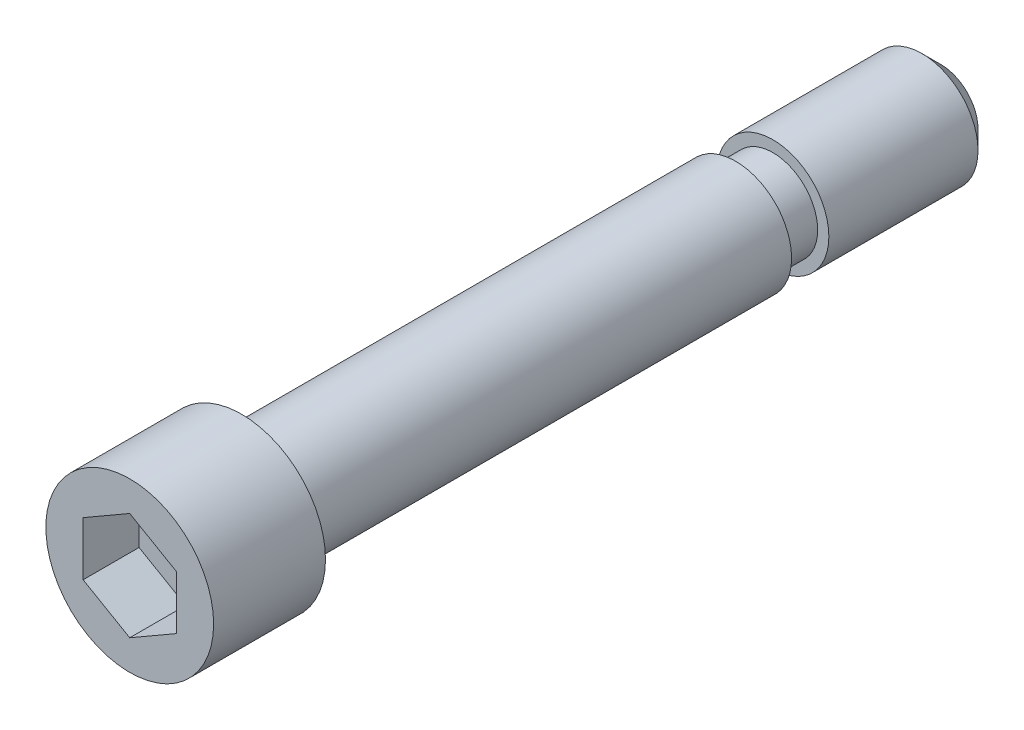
ISO-10303-21;
HEADER;
FILE_DESCRIPTION(('STEP AP214'),'2;1');
FILE_NAME('part.step','',(''),(''),'','','');
FILE_SCHEMA(('AUTOMOTIVE_DESIGN { 1 0 10303 214 1 1 1 1 }'));
ENDSEC;
DATA;
#1=APPLICATION_CONTEXT('core data for automotive mechanical design processes');
#2=APPLICATION_PROTOCOL_DEFINITION('international standard','automotive_design',2000,#1);
#3=PRODUCT_CONTEXT('',#1,'mechanical');
#4=PRODUCT('Part','Part','',(#3));
#5=PRODUCT_RELATED_PRODUCT_CATEGORY('part','',(#4));
#6=PRODUCT_DEFINITION_FORMATION('','',#4);
#7=PRODUCT_DEFINITION_CONTEXT('part definition',#1,'design');
#8=PRODUCT_DEFINITION('design','',#6,#7);
#9=PRODUCT_DEFINITION_SHAPE('','',#8);
#10=(LENGTH_UNIT() NAMED_UNIT(*) SI_UNIT(.MILLI.,.METRE.));
#11=(NAMED_UNIT(*) PLANE_ANGLE_UNIT() SI_UNIT($,.RADIAN.));
#12=(NAMED_UNIT(*) SI_UNIT($,.STERADIAN.) SOLID_ANGLE_UNIT());
#13=UNCERTAINTY_MEASURE_WITH_UNIT(LENGTH_MEASURE(1.E-05),#10,'distance_accuracy_value','');
#14=(GEOMETRIC_REPRESENTATION_CONTEXT(3) GLOBAL_UNCERTAINTY_ASSIGNED_CONTEXT((#13)) GLOBAL_UNIT_ASSIGNED_CONTEXT((#10,
#11,#12)) REPRESENTATION_CONTEXT('',''));
#15=CARTESIAN_POINT('',(0.,0.,0.));
#16=DIRECTION('',(0.,0.,1.));
#17=DIRECTION('',(1.,0.,0.));
#18=AXIS2_PLACEMENT_3D('',#15,#16,#17);
#19=CARTESIAN_POINT('',(0.,0.,-75.));
#20=DIRECTION('',(0.,0.,1.));
#21=DIRECTION('',(1.,0.,0.));
#22=AXIS2_PLACEMENT_3D('',#19,#20,#21);
#23=PLANE('',#22);
#24=CARTESIAN_POINT('',(0.,0.,-75.));
#25=DIRECTION('',(0.,0.,1.));
#26=DIRECTION('',(1.,0.,0.));
#27=AXIS2_PLACEMENT_3D('',#24,#25,#26);
#28=CIRCLE('',#27,4.);
#29=CARTESIAN_POINT('',(4.,0.,-75.));
#30=VERTEX_POINT('',#29);
#31=EDGE_CURVE('E9',#30,#30,#28,.T.);
#32=ORIENTED_EDGE('',*,*,#31,.F.);
#33=EDGE_LOOP('',(#32));
#34=FACE_BOUND('',#33,.T.);
#35=ADVANCED_FACE('F14',(#34),#23,.F.);
#36=CARTESIAN_POINT('',(0.,0.,-75.));
#37=DIRECTION('',(0.,0.,1.));
#38=DIRECTION('',(1.,0.,0.));
#39=AXIS2_PLACEMENT_3D('',#36,#37,#38);
#40=CONICAL_SURFACE('',#39,4.,0.785398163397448);
#41=CARTESIAN_POINT('',(0.,0.,-73.));
#42=DIRECTION('',(0.,0.,1.));
#43=DIRECTION('',(1.,0.,0.));
#44=AXIS2_PLACEMENT_3D('',#41,#42,#43);
#45=CIRCLE('',#44,6.);
#46=CARTESIAN_POINT('',(6.,0.,-73.));
#47=VERTEX_POINT('',#46);
#48=EDGE_CURVE('E21',#47,#47,#45,.T.);
#49=ORIENTED_EDGE('',*,*,#48,.F.);
#50=EDGE_LOOP('',(#49));
#51=FACE_BOUND('',#50,.T.);
#52=ORIENTED_EDGE('',*,*,#31,.T.);
#53=EDGE_LOOP('',(#52));
#54=FACE_BOUND('',#53,.T.);
#55=ADVANCED_FACE('F147',(#51,#54),#40,.T.);
#56=CARTESIAN_POINT('',(0.,0.,5.));
#57=DIRECTION('',(0.,0.,1.));
#58=DIRECTION('',(1.,0.,0.));
#59=AXIS2_PLACEMENT_3D('',#56,#57,#58);
#60=CYLINDRICAL_SURFACE('',#59,6.);
#61=CARTESIAN_POINT('',(0.,0.,-57.));
#62=DIRECTION('',(0.,0.,1.));
#63=DIRECTION('',(1.,0.,0.));
#64=AXIS2_PLACEMENT_3D('',#61,#62,#63);
#65=CIRCLE('',#64,6.);
#66=CARTESIAN_POINT('',(6.,0.,-57.));
#67=VERTEX_POINT('',#66);
#68=EDGE_CURVE('E140',#67,#67,#65,.T.);
#69=ORIENTED_EDGE('',*,*,#68,.F.);
#70=EDGE_LOOP('',(#69));
#71=FACE_BOUND('',#70,.T.);
#72=ORIENTED_EDGE('',*,*,#48,.T.);
#73=EDGE_LOOP('',(#72));
#74=FACE_BOUND('',#73,.T.);
#75=ADVANCED_FACE('F145',(#71,#74),#60,.T.);
#76=CARTESIAN_POINT('',(-6.,0.,-57.));
#77=DIRECTION('',(0.,0.,-1.));
#78=DIRECTION('',(-1.,0.,0.));
#79=AXIS2_PLACEMENT_3D('',#76,#77,#78);
#80=PLANE('',#79);
#81=CARTESIAN_POINT('',(0.,0.,-57.));
#82=DIRECTION('',(0.,0.,1.));
#83=DIRECTION('',(1.,0.,0.));
#84=AXIS2_PLACEMENT_3D('',#81,#82,#83);
#85=CIRCLE('',#84,4.8);
#86=CARTESIAN_POINT('',(4.8,0.,-57.));
#87=VERTEX_POINT('',#86);
#88=EDGE_CURVE('E137',#87,#87,#85,.T.);
#89=ORIENTED_EDGE('',*,*,#88,.F.);
#90=EDGE_LOOP('',(#89));
#91=FACE_BOUND('',#90,.T.);
#92=ORIENTED_EDGE('',*,*,#68,.T.);
#93=EDGE_LOOP('',(#92));
#94=FACE_BOUND('',#93,.T.);
#95=ADVANCED_FACE('F170',(#91,#94),#80,.F.);
#96=CARTESIAN_POINT('',(0.,0.,5.));
#97=DIRECTION('',(0.,0.,1.));
#98=DIRECTION('',(1.,0.,0.));
#99=AXIS2_PLACEMENT_3D('',#96,#97,#98);
#100=CYLINDRICAL_SURFACE('',#99,4.8);
#101=CARTESIAN_POINT('',(0.,0.,-53.));
#102=DIRECTION('',(0.,0.,1.));
#103=DIRECTION('',(1.,0.,0.));
#104=AXIS2_PLACEMENT_3D('',#101,#102,#103);
#105=CIRCLE('',#104,4.8);
#106=CARTESIAN_POINT('',(4.8,0.,-53.));
#107=VERTEX_POINT('',#106);
#108=EDGE_CURVE('E134',#107,#107,#105,.T.);
#109=ORIENTED_EDGE('',*,*,#108,.F.);
#110=EDGE_LOOP('',(#109));
#111=FACE_BOUND('',#110,.T.);
#112=ORIENTED_EDGE('',*,*,#88,.T.);
#113=EDGE_LOOP('',(#112));
#114=FACE_BOUND('',#113,.T.);
#115=ADVANCED_FACE('F179',(#111,#114),#100,.T.);
#116=CARTESIAN_POINT('',(-4.8,0.,-53.));
#117=DIRECTION('',(0.,0.,1.));
#118=DIRECTION('',(1.,0.,0.));
#119=AXIS2_PLACEMENT_3D('',#116,#117,#118);
#120=PLANE('',#119);
#121=CARTESIAN_POINT('',(0.,0.,-53.));
#122=DIRECTION('',(0.,0.,1.));
#123=DIRECTION('',(1.,0.,0.));
#124=AXIS2_PLACEMENT_3D('',#121,#122,#123);
#125=CIRCLE('',#124,6.);
#126=CARTESIAN_POINT('',(6.,0.,-53.));
#127=VERTEX_POINT('',#126);
#128=EDGE_CURVE('E131',#127,#127,#125,.T.);
#129=ORIENTED_EDGE('',*,*,#128,.F.);
#130=EDGE_LOOP('',(#129));
#131=FACE_BOUND('',#130,.T.);
#132=ORIENTED_EDGE('',*,*,#108,.T.);
#133=EDGE_LOOP('',(#132));
#134=FACE_BOUND('',#133,.T.);
#135=ADVANCED_FACE('F188',(#131,#134),#120,.F.);
#136=CARTESIAN_POINT('',(0.,0.,5.));
#137=DIRECTION('',(0.,0.,1.));
#138=DIRECTION('',(1.,0.,0.));
#139=AXIS2_PLACEMENT_3D('',#136,#137,#138);
#140=CYLINDRICAL_SURFACE('',#139,6.);
#141=CARTESIAN_POINT('',(0.,0.,0.));
#142=DIRECTION('',(0.,0.,1.));
#143=DIRECTION('',(1.,0.,0.));
#144=AXIS2_PLACEMENT_3D('',#141,#142,#143);
#145=CIRCLE('',#144,6.);
#146=CARTESIAN_POINT('',(6.,0.,0.));
#147=VERTEX_POINT('',#146);
#148=EDGE_CURVE('E128',#147,#147,#145,.T.);
#149=ORIENTED_EDGE('',*,*,#148,.F.);
#150=EDGE_LOOP('',(#149));
#151=FACE_BOUND('',#150,.T.);
#152=ORIENTED_EDGE('',*,*,#128,.T.);
#153=EDGE_LOOP('',(#152));
#154=FACE_BOUND('',#153,.T.);
#155=ADVANCED_FACE('F197',(#151,#154),#140,.T.);
#156=CARTESIAN_POINT('',(-6.,0.,0.));
#157=DIRECTION('',(0.,0.,1.));
#158=DIRECTION('',(1.,0.,0.));
#159=AXIS2_PLACEMENT_3D('',#156,#157,#158);
#160=PLANE('',#159);
#161=CARTESIAN_POINT('',(0.,0.,0.));
#162=DIRECTION('',(0.,0.,1.));
#163=DIRECTION('',(1.,0.,0.));
#164=AXIS2_PLACEMENT_3D('',#161,#162,#163);
#165=CIRCLE('',#164,9.);
#166=CARTESIAN_POINT('',(9.,0.,0.));
#167=VERTEX_POINT('',#166);
#168=EDGE_CURVE('E125',#167,#167,#165,.T.);
#169=ORIENTED_EDGE('',*,*,#168,.F.);
#170=EDGE_LOOP('',(#169));
#171=FACE_BOUND('',#170,.T.);
#172=ORIENTED_EDGE('',*,*,#148,.T.);
#173=EDGE_LOOP('',(#172));
#174=FACE_BOUND('',#173,.T.);
#175=ADVANCED_FACE('F206',(#171,#174),#160,.F.);
#176=CARTESIAN_POINT('',(0.,0.,5.));
#177=DIRECTION('',(0.,0.,1.));
#178=DIRECTION('',(1.,0.,0.));
#179=AXIS2_PLACEMENT_3D('',#176,#177,#178);
#180=CYLINDRICAL_SURFACE('',#179,9.);
#181=CARTESIAN_POINT('',(0.,0.,12.));
#182=DIRECTION('',(0.,0.,1.));
#183=DIRECTION('',(1.,0.,0.));
#184=AXIS2_PLACEMENT_3D('',#181,#182,#183);
#185=CIRCLE('',#184,9.);
#186=CARTESIAN_POINT('',(9.,0.,12.));
#187=VERTEX_POINT('',#186);
#188=EDGE_CURVE('E116',#187,#187,#185,.T.);
#189=ORIENTED_EDGE('',*,*,#188,.F.);
#190=EDGE_LOOP('',(#189));
#191=FACE_BOUND('',#190,.T.);
#192=ORIENTED_EDGE('',*,*,#168,.T.);
#193=EDGE_LOOP('',(#192));
#194=FACE_BOUND('',#193,.T.);
#195=ADVANCED_FACE('F215',(#191,#194),#180,.T.);
#196=CARTESIAN_POINT('',(-9.,0.,12.));
#197=DIRECTION('',(0.,0.,-1.));
#198=DIRECTION('',(-1.,0.,0.));
#199=AXIS2_PLACEMENT_3D('',#196,#197,#198);
#200=PLANE('',#199);
#201=DIRECTION('',(-0.866025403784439,-0.5,0.));
#202=VECTOR('',#201,1.);
#203=CARTESIAN_POINT('',(0.,5.77350269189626,12.));
#204=LINE('',#203,#202);
#205=CARTESIAN_POINT('',(0.,5.77350269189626,12.));
#206=VERTEX_POINT('',#205);
#207=CARTESIAN_POINT('',(-5.,2.88675134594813,12.));
#208=VERTEX_POINT('',#207);
#209=EDGE_CURVE('E82',#206,#208,#204,.T.);
#210=ORIENTED_EDGE('',*,*,#209,.F.);
#211=DIRECTION('',(-0.866025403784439,0.5,0.));
#212=VECTOR('',#211,1.);
#213=CARTESIAN_POINT('',(5.,2.88675134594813,12.));
#214=LINE('',#213,#212);
#215=CARTESIAN_POINT('',(5.,2.88675134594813,12.));
#216=VERTEX_POINT('',#215);
#217=EDGE_CURVE('E28',#216,#206,#214,.T.);
#218=ORIENTED_EDGE('',*,*,#217,.F.);
#219=DIRECTION('',(0.,1.,0.));
#220=VECTOR('',#219,1.);
#221=CARTESIAN_POINT('',(5.,-2.88675134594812,12.));
#222=LINE('',#221,#220);
#223=CARTESIAN_POINT('',(5.,-2.88675134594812,12.));
#224=VERTEX_POINT('',#223);
#225=EDGE_CURVE('E98',#224,#216,#222,.T.);
#226=ORIENTED_EDGE('',*,*,#225,.F.);
#227=DIRECTION('',(0.866025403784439,0.5,0.));
#228=VECTOR('',#227,1.);
#229=CARTESIAN_POINT('',(0.,-5.77350269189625,12.));
#230=LINE('',#229,#228);
#231=CARTESIAN_POINT('',(0.,-5.77350269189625,12.));
#232=VERTEX_POINT('',#231);
#233=EDGE_CURVE('E92',#232,#224,#230,.T.);
#234=ORIENTED_EDGE('',*,*,#233,.F.);
#235=DIRECTION('',(0.866025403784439,-0.5,0.));
#236=VECTOR('',#235,1.);
#237=CARTESIAN_POINT('',(-5.,-2.88675134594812,12.));
#238=LINE('',#237,#236);
#239=CARTESIAN_POINT('',(-5.,-2.88675134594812,12.));
#240=VERTEX_POINT('',#239);
#241=EDGE_CURVE('E90',#240,#232,#238,.T.);
#242=ORIENTED_EDGE('',*,*,#241,.F.);
#243=DIRECTION('',(0.,-1.,0.));
#244=VECTOR('',#243,1.);
#245=CARTESIAN_POINT('',(-5.,2.88675134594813,12.));
#246=LINE('',#245,#244);
#247=EDGE_CURVE('E71',#208,#240,#246,.T.);
#248=ORIENTED_EDGE('',*,*,#247,.F.);
#249=EDGE_LOOP('',(#210,#218,#226,#234,#242,#248));
#250=FACE_BOUND('',#249,.T.);
#251=ORIENTED_EDGE('',*,*,#188,.T.);
#252=EDGE_LOOP('',(#251));
#253=FACE_BOUND('',#252,.T.);
#254=ADVANCED_FACE('F86',(#250,#253),#200,.F.);
#255=CARTESIAN_POINT('',(5.,2.88675134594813,6.));
#256=DIRECTION('',(0.5,0.866025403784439,0.));
#257=DIRECTION('',(-0.866025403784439,0.5,0.));
#258=AXIS2_PLACEMENT_3D('',#255,#256,#257);
#259=PLANE('',#258);
#260=ORIENTED_EDGE('',*,*,#217,.T.);
#261=DIRECTION('',(0.,0.,1.));
#262=VECTOR('',#261,1.);
#263=CARTESIAN_POINT('',(0.,5.77350269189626,6.));
#264=LINE('',#263,#262);
#265=CARTESIAN_POINT('',(0.,5.77350269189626,6.));
#266=VERTEX_POINT('',#265);
#267=EDGE_CURVE('E79',#266,#206,#264,.T.);
#268=ORIENTED_EDGE('',*,*,#267,.F.);
#269=DIRECTION('',(-0.866025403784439,0.5,0.));
#270=VECTOR('',#269,1.);
#271=CARTESIAN_POINT('',(5.,2.88675134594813,6.));
#272=LINE('',#271,#270);
#273=CARTESIAN_POINT('',(5.,2.88675134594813,6.));
#274=VERTEX_POINT('',#273);
#275=EDGE_CURVE('E100',#274,#266,#272,.T.);
#276=ORIENTED_EDGE('',*,*,#275,.F.);
#277=DIRECTION('',(0.,0.,1.));
#278=VECTOR('',#277,1.);
#279=CARTESIAN_POINT('',(5.,2.88675134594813,6.));
#280=LINE('',#279,#278);
#281=EDGE_CURVE('E35',#274,#216,#280,.T.);
#282=ORIENTED_EDGE('',*,*,#281,.T.);
#283=EDGE_LOOP('',(#260,#268,#276,#282));
#284=FACE_BOUND('',#283,.T.);
#285=ADVANCED_FACE('F232',(#284),#259,.F.);
#286=CARTESIAN_POINT('',(5.,-2.88675134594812,6.));
#287=DIRECTION('',(1.,0.,0.));
#288=DIRECTION('',(0.,0.,-1.));
#289=AXIS2_PLACEMENT_3D('',#286,#287,#288);
#290=PLANE('',#289);
#291=ORIENTED_EDGE('',*,*,#225,.T.);
#292=ORIENTED_EDGE('',*,*,#281,.F.);
#293=DIRECTION('',(0.,1.,0.));
#294=VECTOR('',#293,1.);
#295=CARTESIAN_POINT('',(5.,-2.88675134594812,6.));
#296=LINE('',#295,#294);
#297=CARTESIAN_POINT('',(5.,-2.88675134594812,6.));
#298=VERTEX_POINT('',#297);
#299=EDGE_CURVE('E112',#298,#274,#296,.T.);
#300=ORIENTED_EDGE('',*,*,#299,.F.);
#301=DIRECTION('',(0.,0.,1.));
#302=VECTOR('',#301,1.);
#303=CARTESIAN_POINT('',(5.,-2.88675134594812,6.));
#304=LINE('',#303,#302);
#305=EDGE_CURVE('E117',#298,#224,#304,.T.);
#306=ORIENTED_EDGE('',*,*,#305,.T.);
#307=EDGE_LOOP('',(#291,#292,#300,#306));
#308=FACE_BOUND('',#307,.T.);
#309=ADVANCED_FACE('F240',(#308),#290,.F.);
#310=CARTESIAN_POINT('',(0.,-5.77350269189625,6.));
#311=DIRECTION('',(0.5,-0.866025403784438,0.));
#312=DIRECTION('',(0.866025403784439,0.5,0.));
#313=AXIS2_PLACEMENT_3D('',#310,#311,#312);
#314=PLANE('',#313);
#315=ORIENTED_EDGE('',*,*,#233,.T.);
#316=ORIENTED_EDGE('',*,*,#305,.F.);
#317=DIRECTION('',(0.866025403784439,0.5,0.));
#318=VECTOR('',#317,1.);
#319=CARTESIAN_POINT('',(0.,-5.77350269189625,6.));
#320=LINE('',#319,#318);
#321=CARTESIAN_POINT('',(0.,-5.77350269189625,6.));
#322=VERTEX_POINT('',#321);
#323=EDGE_CURVE('E109',#322,#298,#320,.T.);
#324=ORIENTED_EDGE('',*,*,#323,.F.);
#325=DIRECTION('',(0.,0.,1.));
#326=VECTOR('',#325,1.);
#327=CARTESIAN_POINT('',(0.,-5.77350269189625,6.));
#328=LINE('',#327,#326);
#329=EDGE_CURVE('E119',#322,#232,#328,.T.);
#330=ORIENTED_EDGE('',*,*,#329,.T.);
#331=EDGE_LOOP('',(#315,#316,#324,#330));
#332=FACE_BOUND('',#331,.T.);
#333=ADVANCED_FACE('F248',(#332),#314,.F.);
#334=CARTESIAN_POINT('',(-5.,-2.88675134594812,6.));
#335=DIRECTION('',(-0.5,-0.866025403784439,0.));
#336=DIRECTION('',(0.866025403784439,-0.5,0.));
#337=AXIS2_PLACEMENT_3D('',#334,#335,#336);
#338=PLANE('',#337);
#339=ORIENTED_EDGE('',*,*,#241,.T.);
#340=ORIENTED_EDGE('',*,*,#329,.F.);
#341=DIRECTION('',(0.866025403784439,-0.5,0.));
#342=VECTOR('',#341,1.);
#343=CARTESIAN_POINT('',(-5.,-2.88675134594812,6.));
#344=LINE('',#343,#342);
#345=CARTESIAN_POINT('',(-5.,-2.88675134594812,6.));
#346=VERTEX_POINT('',#345);
#347=EDGE_CURVE('E106',#346,#322,#344,.T.);
#348=ORIENTED_EDGE('',*,*,#347,.F.);
#349=DIRECTION('',(0.,0.,1.));
#350=VECTOR('',#349,1.);
#351=CARTESIAN_POINT('',(-5.,-2.88675134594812,6.));
#352=LINE('',#351,#350);
#353=EDGE_CURVE('E78',#346,#240,#352,.T.);
#354=ORIENTED_EDGE('',*,*,#353,.T.);
#355=EDGE_LOOP('',(#339,#340,#348,#354));
#356=FACE_BOUND('',#355,.T.);
#357=ADVANCED_FACE('F256',(#356),#338,.F.);
#358=CARTESIAN_POINT('',(-5.,2.88675134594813,6.));
#359=DIRECTION('',(-1.,0.,0.));
#360=DIRECTION('',(0.,0.,1.));
#361=AXIS2_PLACEMENT_3D('',#358,#359,#360);
#362=PLANE('',#361);
#363=ORIENTED_EDGE('',*,*,#247,.T.);
#364=ORIENTED_EDGE('',*,*,#353,.F.);
#365=DIRECTION('',(0.,-1.,0.));
#366=VECTOR('',#365,1.);
#367=CARTESIAN_POINT('',(-5.,2.88675134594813,6.));
#368=LINE('',#367,#366);
#369=CARTESIAN_POINT('',(-5.,2.88675134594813,6.));
#370=VERTEX_POINT('',#369);
#371=EDGE_CURVE('E74',#370,#346,#368,.T.);
#372=ORIENTED_EDGE('',*,*,#371,.F.);
#373=DIRECTION('',(0.,0.,1.));
#374=VECTOR('',#373,1.);
#375=CARTESIAN_POINT('',(-5.,2.88675134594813,6.));
#376=LINE('',#375,#374);
#377=EDGE_CURVE('E67',#370,#208,#376,.T.);
#378=ORIENTED_EDGE('',*,*,#377,.T.);
#379=EDGE_LOOP('',(#363,#364,#372,#378));
#380=FACE_BOUND('',#379,.T.);
#381=ADVANCED_FACE('F69',(#380),#362,.F.);
#382=CARTESIAN_POINT('',(0.,5.77350269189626,6.));
#383=DIRECTION('',(-0.5,0.866025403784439,0.));
#384=DIRECTION('',(-0.866025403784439,-0.5,0.));
#385=AXIS2_PLACEMENT_3D('',#382,#383,#384);
#386=PLANE('',#385);
#387=ORIENTED_EDGE('',*,*,#209,.T.);
#388=ORIENTED_EDGE('',*,*,#377,.F.);
#389=DIRECTION('',(-0.866025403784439,-0.5,0.));
#390=VECTOR('',#389,1.);
#391=CARTESIAN_POINT('',(0.,5.77350269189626,6.));
#392=LINE('',#391,#390);
#393=EDGE_CURVE('E103',#266,#370,#392,.T.);
#394=ORIENTED_EDGE('',*,*,#393,.F.);
#395=ORIENTED_EDGE('',*,*,#267,.T.);
#396=EDGE_LOOP('',(#387,#388,#394,#395));
#397=FACE_BOUND('',#396,.T.);
#398=ADVANCED_FACE('F83',(#397),#386,.F.);
#399=CARTESIAN_POINT('',(5.,2.88675134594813,6.));
#400=DIRECTION('',(0.,0.,-1.));
#401=DIRECTION('',(-1.,0.,0.));
#402=AXIS2_PLACEMENT_3D('',#399,#400,#401);
#403=PLANE('',#402);
#404=ORIENTED_EDGE('',*,*,#275,.T.);
#405=ORIENTED_EDGE('',*,*,#393,.T.);
#406=ORIENTED_EDGE('',*,*,#371,.T.);
#407=ORIENTED_EDGE('',*,*,#347,.T.);
#408=ORIENTED_EDGE('',*,*,#323,.T.);
#409=ORIENTED_EDGE('',*,*,#299,.T.);
#410=EDGE_LOOP('',(#404,#405,#406,#407,#408,#409));
#411=FACE_BOUND('',#410,.T.);
#412=ADVANCED_FACE('F280',(#411),#403,.F.);
#413=CLOSED_SHELL('',(#35,#55,#75,#95,#115,#135,#155,#175,#195,#254,#285,#309,#333,#357,#381,
#398,#412));
#414=MANIFOLD_SOLID_BREP('B1',#413);
#415=ADVANCED_BREP_SHAPE_REPRESENTATION('',(#18,#414),#14);
#416=SHAPE_DEFINITION_REPRESENTATION(#9,#415);
ENDSEC;
END-ISO-10303-21;
